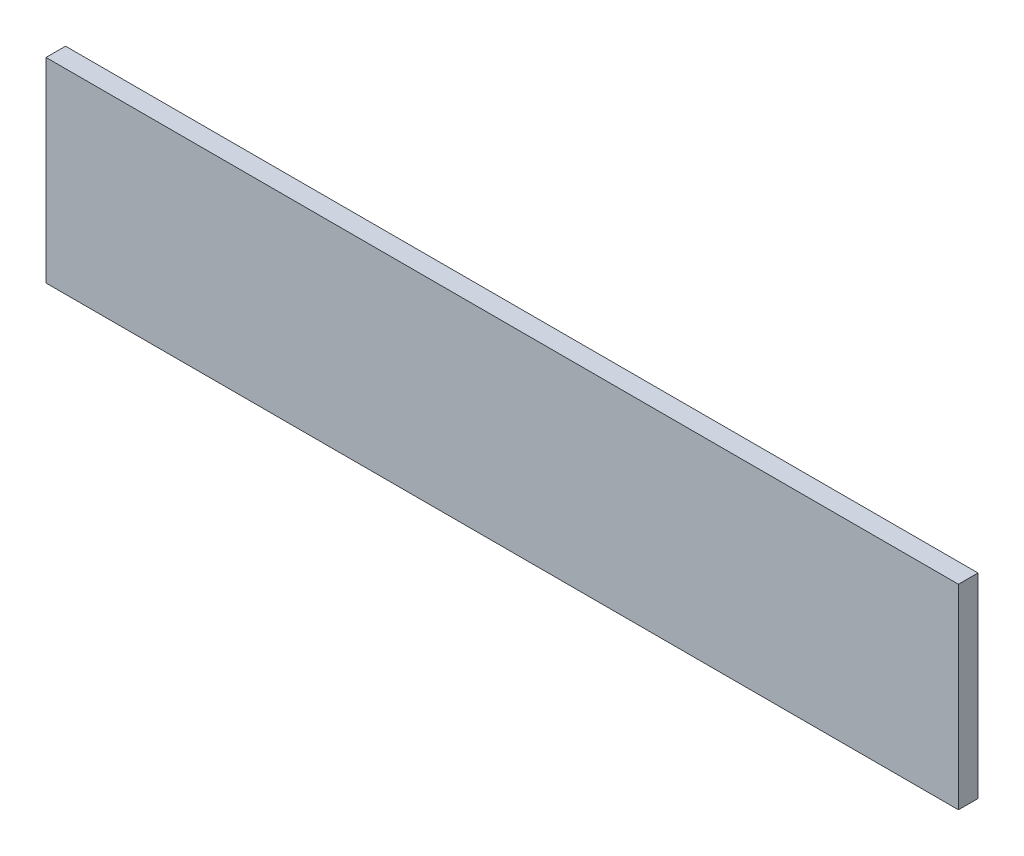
ISO-10303-21;
HEADER;
FILE_DESCRIPTION(('STEP AP214'),'2;1');
FILE_NAME('part.step','',(''),(''),'','','');
FILE_SCHEMA(('AUTOMOTIVE_DESIGN { 1 0 10303 214 1 1 1 1 }'));
ENDSEC;
DATA;
#1=APPLICATION_CONTEXT('core data for automotive mechanical design processes');
#2=APPLICATION_PROTOCOL_DEFINITION('international standard','automotive_design',2000,#1);
#3=PRODUCT_CONTEXT('',#1,'mechanical');
#4=PRODUCT('Part','Part','',(#3));
#5=PRODUCT_RELATED_PRODUCT_CATEGORY('part','',(#4));
#6=PRODUCT_DEFINITION_FORMATION('','',#4);
#7=PRODUCT_DEFINITION_CONTEXT('part definition',#1,'design');
#8=PRODUCT_DEFINITION('design','',#6,#7);
#9=PRODUCT_DEFINITION_SHAPE('','',#8);
#10=(LENGTH_UNIT() NAMED_UNIT(*) SI_UNIT(.MILLI.,.METRE.));
#11=(NAMED_UNIT(*) PLANE_ANGLE_UNIT() SI_UNIT($,.RADIAN.));
#12=(NAMED_UNIT(*) SI_UNIT($,.STERADIAN.) SOLID_ANGLE_UNIT());
#13=UNCERTAINTY_MEASURE_WITH_UNIT(LENGTH_MEASURE(1.E-05),#10,'distance_accuracy_value','');
#14=(GEOMETRIC_REPRESENTATION_CONTEXT(3) GLOBAL_UNCERTAINTY_ASSIGNED_CONTEXT((#13)) GLOBAL_UNIT_ASSIGNED_CONTEXT((#10,
#11,#12)) REPRESENTATION_CONTEXT('',''));
#15=CARTESIAN_POINT('',(0.,0.,0.));
#16=DIRECTION('',(0.,0.,1.));
#17=DIRECTION('',(1.,0.,0.));
#18=AXIS2_PLACEMENT_3D('',#15,#16,#17);
#19=CARTESIAN_POINT('',(233.5,50.,10.));
#20=DIRECTION('',(-1.,0.,0.));
#21=DIRECTION('',(0.,-1.,0.));
#22=AXIS2_PLACEMENT_3D('',#19,#20,#21);
#23=PLANE('',#22);
#24=DIRECTION('',(0.,1.,0.));
#25=VECTOR('',#24,1.);
#26=CARTESIAN_POINT('',(233.5,50.,0.));
#27=LINE('',#26,#25);
#28=CARTESIAN_POINT('',(233.5,-50.,0.));
#29=VERTEX_POINT('',#28);
#30=CARTESIAN_POINT('',(233.5,50.,0.));
#31=VERTEX_POINT('',#30);
#32=EDGE_CURVE('E107',#29,#31,#27,.T.);
#33=ORIENTED_EDGE('',*,*,#32,.T.);
#34=DIRECTION('',(0.,0.,-1.));
#35=VECTOR('',#34,1.);
#36=CARTESIAN_POINT('',(233.5,50.,10.));
#37=LINE('',#36,#35);
#38=CARTESIAN_POINT('',(233.5,50.,10.));
#39=VERTEX_POINT('',#38);
#40=EDGE_CURVE('E11',#39,#31,#37,.T.);
#41=ORIENTED_EDGE('',*,*,#40,.F.);
#42=DIRECTION('',(0.,1.,0.));
#43=VECTOR('',#42,1.);
#44=CARTESIAN_POINT('',(233.5,50.,10.));
#45=LINE('',#44,#43);
#46=CARTESIAN_POINT('',(233.5,-50.,10.));
#47=VERTEX_POINT('',#46);
#48=EDGE_CURVE('E91',#47,#39,#45,.T.);
#49=ORIENTED_EDGE('',*,*,#48,.F.);
#50=DIRECTION('',(0.,0.,-1.));
#51=VECTOR('',#50,1.);
#52=CARTESIAN_POINT('',(233.5,-50.,10.));
#53=LINE('',#52,#51);
#54=EDGE_CURVE('E103',#47,#29,#53,.T.);
#55=ORIENTED_EDGE('',*,*,#54,.T.);
#56=EDGE_LOOP('',(#33,#41,#49,#55));
#57=FACE_BOUND('',#56,.T.);
#58=ADVANCED_FACE('F39',(#57),#23,.F.);
#59=CARTESIAN_POINT('',(-233.5,50.,10.));
#60=DIRECTION('',(0.,-1.,0.));
#61=DIRECTION('',(0.,0.,-1.));
#62=AXIS2_PLACEMENT_3D('',#59,#60,#61);
#63=PLANE('',#62);
#64=DIRECTION('',(-1.,0.,0.));
#65=VECTOR('',#64,1.);
#66=CARTESIAN_POINT('',(-233.5,50.,0.));
#67=LINE('',#66,#65);
#68=CARTESIAN_POINT('',(-233.5,50.,0.));
#69=VERTEX_POINT('',#68);
#70=EDGE_CURVE('E96',#31,#69,#67,.T.);
#71=ORIENTED_EDGE('',*,*,#70,.T.);
#72=DIRECTION('',(0.,0.,-1.));
#73=VECTOR('',#72,1.);
#74=CARTESIAN_POINT('',(-233.5,50.,10.));
#75=LINE('',#74,#73);
#76=CARTESIAN_POINT('',(-233.5,50.,10.));
#77=VERTEX_POINT('',#76);
#78=EDGE_CURVE('E48',#77,#69,#75,.T.);
#79=ORIENTED_EDGE('',*,*,#78,.F.);
#80=DIRECTION('',(-1.,0.,0.));
#81=VECTOR('',#80,1.);
#82=CARTESIAN_POINT('',(-233.5,50.,10.));
#83=LINE('',#82,#81);
#84=EDGE_CURVE('E86',#39,#77,#83,.T.);
#85=ORIENTED_EDGE('',*,*,#84,.F.);
#86=ORIENTED_EDGE('',*,*,#40,.T.);
#87=EDGE_LOOP('',(#71,#79,#85,#86));
#88=FACE_BOUND('',#87,.T.);
#89=ADVANCED_FACE('F95',(#88),#63,.F.);
#90=CARTESIAN_POINT('',(-233.5,50.,10.));
#91=DIRECTION('',(1.,0.,0.));
#92=DIRECTION('',(0.,1.,0.));
#93=AXIS2_PLACEMENT_3D('',#90,#91,#92);
#94=PLANE('',#93);
#95=DIRECTION('',(0.,-1.,0.));
#96=VECTOR('',#95,1.);
#97=CARTESIAN_POINT('',(-233.5,50.,0.));
#98=LINE('',#97,#96);
#99=CARTESIAN_POINT('',(-233.5,-50.,0.));
#100=VERTEX_POINT('',#99);
#101=EDGE_CURVE('E73',#69,#100,#98,.T.);
#102=ORIENTED_EDGE('',*,*,#101,.T.);
#103=DIRECTION('',(0.,0.,-1.));
#104=VECTOR('',#103,1.);
#105=CARTESIAN_POINT('',(-233.5,-50.,10.));
#106=LINE('',#105,#104);
#107=CARTESIAN_POINT('',(-233.5,-50.,10.));
#108=VERTEX_POINT('',#107);
#109=EDGE_CURVE('E98',#108,#100,#106,.T.);
#110=ORIENTED_EDGE('',*,*,#109,.F.);
#111=DIRECTION('',(0.,-1.,0.));
#112=VECTOR('',#111,1.);
#113=CARTESIAN_POINT('',(-233.5,50.,10.));
#114=LINE('',#113,#112);
#115=EDGE_CURVE('E89',#77,#108,#114,.T.);
#116=ORIENTED_EDGE('',*,*,#115,.F.);
#117=ORIENTED_EDGE('',*,*,#78,.T.);
#118=EDGE_LOOP('',(#102,#110,#116,#117));
#119=FACE_BOUND('',#118,.T.);
#120=ADVANCED_FACE('F99',(#119),#94,.F.);
#121=CARTESIAN_POINT('',(-233.5,-50.,10.));
#122=DIRECTION('',(0.,1.,0.));
#123=DIRECTION('',(0.,0.,1.));
#124=AXIS2_PLACEMENT_3D('',#121,#122,#123);
#125=PLANE('',#124);
#126=DIRECTION('',(1.,0.,0.));
#127=VECTOR('',#126,1.);
#128=CARTESIAN_POINT('',(-233.5,-50.,0.));
#129=LINE('',#128,#127);
#130=EDGE_CURVE('E79',#100,#29,#129,.T.);
#131=ORIENTED_EDGE('',*,*,#130,.T.);
#132=ORIENTED_EDGE('',*,*,#54,.F.);
#133=DIRECTION('',(1.,0.,0.));
#134=VECTOR('',#133,1.);
#135=CARTESIAN_POINT('',(-233.5,-50.,10.));
#136=LINE('',#135,#134);
#137=EDGE_CURVE('E56',#108,#47,#136,.T.);
#138=ORIENTED_EDGE('',*,*,#137,.F.);
#139=ORIENTED_EDGE('',*,*,#109,.T.);
#140=EDGE_LOOP('',(#131,#132,#138,#139));
#141=FACE_BOUND('',#140,.T.);
#142=ADVANCED_FACE('F120',(#141),#125,.F.);
#143=CARTESIAN_POINT('',(0.,0.,10.));
#144=DIRECTION('',(0.,0.,1.));
#145=DIRECTION('',(1.,0.,0.));
#146=AXIS2_PLACEMENT_3D('',#143,#144,#145);
#147=PLANE('',#146);
#148=ORIENTED_EDGE('',*,*,#48,.T.);
#149=ORIENTED_EDGE('',*,*,#84,.T.);
#150=ORIENTED_EDGE('',*,*,#115,.T.);
#151=ORIENTED_EDGE('',*,*,#137,.T.);
#152=EDGE_LOOP('',(#148,#149,#150,#151));
#153=FACE_BOUND('',#152,.T.);
#154=ADVANCED_FACE('F87',(#153),#147,.T.);
#155=CARTESIAN_POINT('',(0.,0.,0.));
#156=DIRECTION('',(0.,0.,1.));
#157=DIRECTION('',(1.,0.,0.));
#158=AXIS2_PLACEMENT_3D('',#155,#156,#157);
#159=PLANE('',#158);
#160=ORIENTED_EDGE('',*,*,#32,.F.);
#161=ORIENTED_EDGE('',*,*,#130,.F.);
#162=ORIENTED_EDGE('',*,*,#101,.F.);
#163=ORIENTED_EDGE('',*,*,#70,.F.);
#164=EDGE_LOOP('',(#160,#161,#162,#163));
#165=FACE_BOUND('',#164,.T.);
#166=ADVANCED_FACE('F123',(#165),#159,.F.);
#167=CLOSED_SHELL('',(#58,#89,#120,#142,#154,#166));
#168=MANIFOLD_SOLID_BREP('B2',#167);
#169=ADVANCED_BREP_SHAPE_REPRESENTATION('',(#18,#168),#14);
#170=SHAPE_DEFINITION_REPRESENTATION(#9,#169);
ENDSEC;
END-ISO-10303-21;
